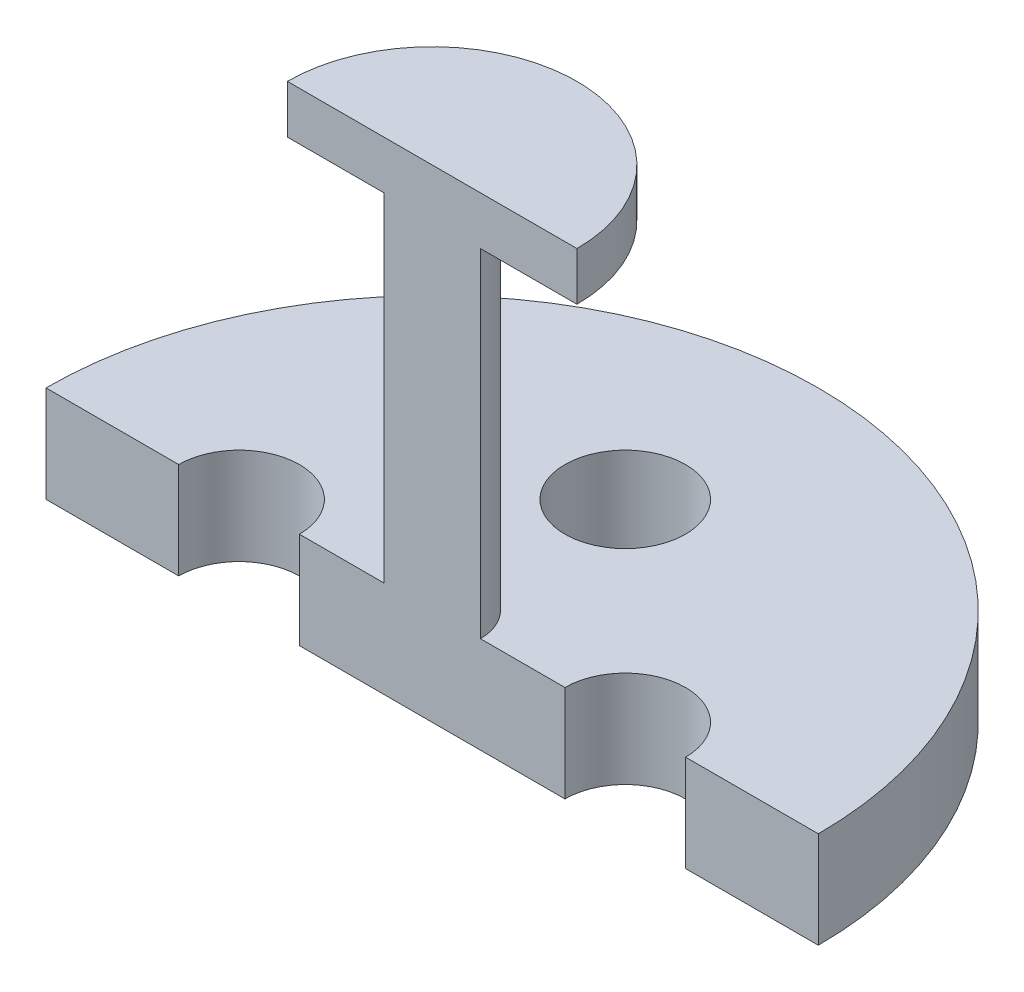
ISO-10303-21;
HEADER;
FILE_DESCRIPTION(('STEP AP214'),'2;1');
FILE_NAME('part.step','',(''),(''),'','','');
FILE_SCHEMA(('AUTOMOTIVE_DESIGN { 1 0 10303 214 1 1 1 1 }'));
ENDSEC;
DATA;
#1=APPLICATION_CONTEXT('core data for automotive mechanical design processes');
#2=APPLICATION_PROTOCOL_DEFINITION('international standard','automotive_design',2000,#1);
#3=PRODUCT_CONTEXT('',#1,'mechanical');
#4=PRODUCT('Part','Part','',(#3));
#5=PRODUCT_RELATED_PRODUCT_CATEGORY('part','',(#4));
#6=PRODUCT_DEFINITION_FORMATION('','',#4);
#7=PRODUCT_DEFINITION_CONTEXT('part definition',#1,'design');
#8=PRODUCT_DEFINITION('design','',#6,#7);
#9=PRODUCT_DEFINITION_SHAPE('','',#8);
#10=(LENGTH_UNIT() NAMED_UNIT(*) SI_UNIT(.MILLI.,.METRE.));
#11=(NAMED_UNIT(*) PLANE_ANGLE_UNIT() SI_UNIT($,.RADIAN.));
#12=(NAMED_UNIT(*) SI_UNIT($,.STERADIAN.) SOLID_ANGLE_UNIT());
#13=UNCERTAINTY_MEASURE_WITH_UNIT(LENGTH_MEASURE(1.E-05),#10,'distance_accuracy_value','');
#14=(GEOMETRIC_REPRESENTATION_CONTEXT(3) GLOBAL_UNCERTAINTY_ASSIGNED_CONTEXT((#13)) GLOBAL_UNIT_ASSIGNED_CONTEXT((#10,
#11,#12)) REPRESENTATION_CONTEXT('',''));
#15=CARTESIAN_POINT('',(0.,0.,0.));
#16=DIRECTION('',(0.,0.,1.));
#17=DIRECTION('',(1.,0.,0.));
#18=AXIS2_PLACEMENT_3D('',#15,#16,#17);
#19=CARTESIAN_POINT('',(0.,71.5910269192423,0.));
#20=DIRECTION('',(0.,1.,0.));
#21=DIRECTION('',(-1.,0.,0.));
#22=AXIS2_PLACEMENT_3D('',#19,#20,#21);
#23=CYLINDRICAL_SURFACE('',#22,8.);
#24=DIRECTION('',(0.,1.,0.));
#25=VECTOR('',#24,1.);
#26=CARTESIAN_POINT('',(-7.99999999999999,0.,0.));
#27=LINE('',#26,#25);
#28=CARTESIAN_POINT('',(-7.99999999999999,0.,0.));
#29=VERTEX_POINT('',#28);
#30=CARTESIAN_POINT('',(-7.99999999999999,2.,0.));
#31=VERTEX_POINT('',#30);
#32=EDGE_CURVE('E124',#29,#31,#27,.T.);
#33=ORIENTED_EDGE('',*,*,#32,.T.);
#34=CARTESIAN_POINT('',(0.,2.,0.));
#35=DIRECTION('',(0.,1.,0.));
#36=DIRECTION('',(-1.,0.,0.));
#37=AXIS2_PLACEMENT_3D('',#34,#35,#36);
#38=CIRCLE('',#37,8.);
#39=CARTESIAN_POINT('',(8.00000000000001,2.,0.));
#40=VERTEX_POINT('',#39);
#41=EDGE_CURVE('E123',#40,#31,#38,.T.);
#42=ORIENTED_EDGE('',*,*,#41,.F.);
#43=DIRECTION('',(0.,1.,0.));
#44=VECTOR('',#43,1.);
#45=CARTESIAN_POINT('',(8.00000000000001,0.,0.));
#46=LINE('',#45,#44);
#47=CARTESIAN_POINT('',(8.00000000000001,0.,0.));
#48=VERTEX_POINT('',#47);
#49=EDGE_CURVE('E109',#48,#40,#46,.T.);
#50=ORIENTED_EDGE('',*,*,#49,.F.);
#51=CARTESIAN_POINT('',(0.,0.,0.));
#52=DIRECTION('',(0.,1.,0.));
#53=DIRECTION('',(-1.,0.,0.));
#54=AXIS2_PLACEMENT_3D('',#51,#52,#53);
#55=CIRCLE('',#54,8.);
#56=EDGE_CURVE('E121',#48,#29,#55,.T.);
#57=ORIENTED_EDGE('',*,*,#56,.T.);
#58=EDGE_LOOP('',(#33,#42,#50,#57));
#59=FACE_BOUND('',#58,.T.);
#60=ADVANCED_FACE('F31',(#59),#23,.T.);
#61=CARTESIAN_POINT('',(0.,10.,0.));
#62=DIRECTION('',(0.,1.,0.));
#63=DIRECTION('',(-1.,0.,0.));
#64=AXIS2_PLACEMENT_3D('',#61,#62,#63);
#65=PLANE('',#64);
#66=DIRECTION('',(-1.,0.,0.));
#67=VECTOR('',#66,1.);
#68=CARTESIAN_POINT('',(-7.99999999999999,10.,0.));
#69=LINE('',#68,#67);
#70=CARTESIAN_POINT('',(3.,10.,0.));
#71=VERTEX_POINT('',#70);
#72=CARTESIAN_POINT('',(-2.99999999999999,10.,0.));
#73=VERTEX_POINT('',#72);
#74=EDGE_CURVE('E199',#71,#73,#69,.T.);
#75=ORIENTED_EDGE('',*,*,#74,.F.);
#76=CARTESIAN_POINT('',(0.,10.,0.));
#77=DIRECTION('',(0.,1.,0.));
#78=DIRECTION('',(-1.,0.,0.));
#79=AXIS2_PLACEMENT_3D('',#76,#77,#78);
#80=CIRCLE('',#79,3.);
#81=EDGE_CURVE('E145',#71,#73,#80,.T.);
#82=ORIENTED_EDGE('',*,*,#81,.T.);
#83=EDGE_LOOP('',(#75,#82));
#84=FACE_BOUND('',#83,.T.);
#85=ADVANCED_FACE('F33',(#84),#65,.T.);
#86=CARTESIAN_POINT('',(0.,71.5910269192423,0.));
#87=DIRECTION('',(0.,1.,0.));
#88=DIRECTION('',(-1.,0.,0.));
#89=AXIS2_PLACEMENT_3D('',#86,#87,#88);
#90=CYLINDRICAL_SURFACE('',#89,3.);
#91=DIRECTION('',(0.,1.,0.));
#92=VECTOR('',#91,1.);
#93=CARTESIAN_POINT('',(-3.,71.5910269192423,0.));
#94=LINE('',#93,#92);
#95=CARTESIAN_POINT('',(-2.99999999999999,9.,0.));
#96=VERTEX_POINT('',#95);
#97=EDGE_CURVE('E193',#73,#96,#94,.F.);
#98=ORIENTED_EDGE('',*,*,#97,.F.);
#99=ORIENTED_EDGE('',*,*,#81,.F.);
#100=DIRECTION('',(0.,1.,0.));
#101=VECTOR('',#100,1.);
#102=CARTESIAN_POINT('',(3.,71.5910269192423,0.));
#103=LINE('',#102,#101);
#104=CARTESIAN_POINT('',(3.,9.,0.));
#105=VERTEX_POINT('',#104);
#106=EDGE_CURVE('E180',#105,#71,#103,.T.);
#107=ORIENTED_EDGE('',*,*,#106,.F.);
#108=CARTESIAN_POINT('',(0.,9.00000000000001,0.));
#109=DIRECTION('',(0.,1.,0.));
#110=DIRECTION('',(-1.,0.,0.));
#111=AXIS2_PLACEMENT_3D('',#108,#109,#110);
#112=CIRCLE('',#111,3.);
#113=EDGE_CURVE('E142',#105,#96,#112,.T.);
#114=ORIENTED_EDGE('',*,*,#113,.T.);
#115=EDGE_LOOP('',(#98,#99,#107,#114));
#116=FACE_BOUND('',#115,.T.);
#117=ADVANCED_FACE('F206',(#116),#90,.T.);
#118=CARTESIAN_POINT('',(-2.99999999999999,9.,0.));
#119=DIRECTION('',(0.,-1.,0.));
#120=DIRECTION('',(1.,0.,0.));
#121=AXIS2_PLACEMENT_3D('',#118,#119,#120);
#122=PLANE('',#121);
#123=DIRECTION('',(1.,0.,0.));
#124=VECTOR('',#123,1.);
#125=CARTESIAN_POINT('',(-2.99999999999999,9.,0.));
#126=LINE('',#125,#124);
#127=CARTESIAN_POINT('',(-0.999999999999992,9.00000000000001,0.));
#128=VERTEX_POINT('',#127);
#129=EDGE_CURVE('E189',#96,#128,#126,.T.);
#130=ORIENTED_EDGE('',*,*,#129,.F.);
#131=ORIENTED_EDGE('',*,*,#113,.F.);
#132=CARTESIAN_POINT('',(1.,9.00000000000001,0.));
#133=VERTEX_POINT('',#132);
#134=EDGE_CURVE('E183',#133,#105,#126,.T.);
#135=ORIENTED_EDGE('',*,*,#134,.F.);
#136=CARTESIAN_POINT('',(0.,9.00000000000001,0.));
#137=DIRECTION('',(0.,1.,0.));
#138=DIRECTION('',(-1.,0.,0.));
#139=AXIS2_PLACEMENT_3D('',#136,#137,#138);
#140=CIRCLE('',#139,0.999999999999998);
#141=EDGE_CURVE('E139',#133,#128,#140,.T.);
#142=ORIENTED_EDGE('',*,*,#141,.T.);
#143=EDGE_LOOP('',(#130,#131,#135,#142));
#144=FACE_BOUND('',#143,.T.);
#145=ADVANCED_FACE('F213',(#144),#122,.T.);
#146=CARTESIAN_POINT('',(0.,71.5910269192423,0.));
#147=DIRECTION('',(0.,1.,0.));
#148=DIRECTION('',(-1.,0.,0.));
#149=AXIS2_PLACEMENT_3D('',#146,#147,#148);
#150=CYLINDRICAL_SURFACE('',#149,0.999999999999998);
#151=DIRECTION('',(0.,1.,0.));
#152=VECTOR('',#151,1.);
#153=CARTESIAN_POINT('',(-0.999999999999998,71.5910269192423,0.));
#154=LINE('',#153,#152);
#155=CARTESIAN_POINT('',(-0.999999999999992,2.,0.));
#156=VERTEX_POINT('',#155);
#157=EDGE_CURVE('E195',#128,#156,#154,.F.);
#158=ORIENTED_EDGE('',*,*,#157,.F.);
#159=ORIENTED_EDGE('',*,*,#141,.F.);
#160=DIRECTION('',(0.,1.,0.));
#161=VECTOR('',#160,1.);
#162=CARTESIAN_POINT('',(0.999999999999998,71.5910269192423,0.));
#163=LINE('',#162,#161);
#164=CARTESIAN_POINT('',(1.,2.,0.));
#165=VERTEX_POINT('',#164);
#166=EDGE_CURVE('E187',#165,#133,#163,.T.);
#167=ORIENTED_EDGE('',*,*,#166,.F.);
#168=CARTESIAN_POINT('',(0.,2.,0.));
#169=DIRECTION('',(0.,1.,0.));
#170=DIRECTION('',(-1.,0.,0.));
#171=AXIS2_PLACEMENT_3D('',#168,#169,#170);
#172=CIRCLE('',#171,0.999999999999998);
#173=EDGE_CURVE('E131',#165,#156,#172,.T.);
#174=ORIENTED_EDGE('',*,*,#173,.T.);
#175=EDGE_LOOP('',(#158,#159,#167,#174));
#176=FACE_BOUND('',#175,.T.);
#177=ADVANCED_FACE('F222',(#176),#150,.T.);
#178=CARTESIAN_POINT('',(-0.999999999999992,2.,0.));
#179=DIRECTION('',(0.,1.,0.));
#180=DIRECTION('',(-1.,0.,0.));
#181=AXIS2_PLACEMENT_3D('',#178,#179,#180);
#182=PLANE('',#181);
#183=DIRECTION('',(-1.,0.,0.));
#184=VECTOR('',#183,1.);
#185=CARTESIAN_POINT('',(-0.999999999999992,2.,0.));
#186=LINE('',#185,#184);
#187=CARTESIAN_POINT('',(5.25,2.,0.));
#188=VERTEX_POINT('',#187);
#189=EDGE_CURVE('E46',#40,#188,#186,.T.);
#190=ORIENTED_EDGE('',*,*,#189,.F.);
#191=ORIENTED_EDGE('',*,*,#41,.T.);
#192=CARTESIAN_POINT('',(-5.25,2.,0.));
#193=VERTEX_POINT('',#192);
#194=EDGE_CURVE('E182',#193,#31,#186,.T.);
#195=ORIENTED_EDGE('',*,*,#194,.F.);
#196=CARTESIAN_POINT('',(-4.,2.,0.));
#197=DIRECTION('',(0.,1.,0.));
#198=DIRECTION('',(-1.,0.,0.));
#199=AXIS2_PLACEMENT_3D('',#196,#197,#198);
#200=CIRCLE('',#199,1.25);
#201=CARTESIAN_POINT('',(-2.75,2.,0.));
#202=VERTEX_POINT('',#201);
#203=EDGE_CURVE('E153',#193,#202,#200,.F.);
#204=ORIENTED_EDGE('',*,*,#203,.T.);
#205=EDGE_CURVE('E196',#156,#202,#186,.T.);
#206=ORIENTED_EDGE('',*,*,#205,.F.);
#207=ORIENTED_EDGE('',*,*,#173,.F.);
#208=CARTESIAN_POINT('',(2.75,2.,0.));
#209=VERTEX_POINT('',#208);
#210=EDGE_CURVE('E175',#209,#165,#186,.T.);
#211=ORIENTED_EDGE('',*,*,#210,.F.);
#212=CARTESIAN_POINT('',(4.,2.,0.));
#213=DIRECTION('',(0.,1.,0.));
#214=DIRECTION('',(-1.,0.,0.));
#215=AXIS2_PLACEMENT_3D('',#212,#213,#214);
#216=CIRCLE('',#215,1.25);
#217=EDGE_CURVE('E133',#209,#188,#216,.F.);
#218=ORIENTED_EDGE('',*,*,#217,.T.);
#219=EDGE_LOOP('',(#190,#191,#195,#204,#206,#207,#211,#218));
#220=FACE_BOUND('',#219,.T.);
#221=CARTESIAN_POINT('',(0.,2.,-4.));
#222=DIRECTION('',(0.,1.,0.));
#223=DIRECTION('',(-1.,0.,0.));
#224=AXIS2_PLACEMENT_3D('',#221,#222,#223);
#225=CIRCLE('',#224,1.25);
#226=CARTESIAN_POINT('',(-1.25000000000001,2.,-4.));
#227=VERTEX_POINT('',#226);
#228=EDGE_CURVE('E156',#227,#227,#225,.F.);
#229=ORIENTED_EDGE('',*,*,#228,.T.);
#230=EDGE_LOOP('',(#229));
#231=FACE_BOUND('',#230,.T.);
#232=ADVANCED_FACE('F172',(#220,#231),#182,.T.);
#233=CARTESIAN_POINT('',(-7.99999999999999,0.,0.));
#234=DIRECTION('',(0.,-1.,0.));
#235=DIRECTION('',(1.,0.,0.));
#236=AXIS2_PLACEMENT_3D('',#233,#234,#235);
#237=PLANE('',#236);
#238=DIRECTION('',(-1.,0.,0.));
#239=VECTOR('',#238,1.);
#240=CARTESIAN_POINT('',(-7.99999999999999,0.,0.));
#241=LINE('',#240,#239);
#242=CARTESIAN_POINT('',(-5.25,0.,0.));
#243=VERTEX_POINT('',#242);
#244=EDGE_CURVE('E54',#243,#29,#241,.T.);
#245=ORIENTED_EDGE('',*,*,#244,.T.);
#246=ORIENTED_EDGE('',*,*,#56,.F.);
#247=CARTESIAN_POINT('',(5.25,0.,0.));
#248=VERTEX_POINT('',#247);
#249=EDGE_CURVE('E106',#48,#248,#241,.T.);
#250=ORIENTED_EDGE('',*,*,#249,.T.);
#251=CARTESIAN_POINT('',(4.,0.,0.));
#252=DIRECTION('',(0.,-1.,0.));
#253=DIRECTION('',(1.,0.,0.));
#254=AXIS2_PLACEMENT_3D('',#251,#252,#253);
#255=CIRCLE('',#254,1.25);
#256=CARTESIAN_POINT('',(2.75,0.,0.));
#257=VERTEX_POINT('',#256);
#258=EDGE_CURVE('E129',#257,#248,#255,.T.);
#259=ORIENTED_EDGE('',*,*,#258,.F.);
#260=CARTESIAN_POINT('',(-2.75,0.,0.));
#261=VERTEX_POINT('',#260);
#262=EDGE_CURVE('E115',#257,#261,#241,.T.);
#263=ORIENTED_EDGE('',*,*,#262,.T.);
#264=CARTESIAN_POINT('',(-4.,0.,0.));
#265=DIRECTION('',(0.,-1.,0.));
#266=DIRECTION('',(-1.,0.,0.));
#267=AXIS2_PLACEMENT_3D('',#264,#265,#266);
#268=CIRCLE('',#267,1.25);
#269=EDGE_CURVE('E151',#243,#261,#268,.T.);
#270=ORIENTED_EDGE('',*,*,#269,.F.);
#271=EDGE_LOOP('',(#245,#246,#250,#259,#263,#270));
#272=FACE_BOUND('',#271,.T.);
#273=CARTESIAN_POINT('',(0.,0.,-4.));
#274=DIRECTION('',(0.,-1.,0.));
#275=DIRECTION('',(0.,0.,-1.));
#276=AXIS2_PLACEMENT_3D('',#273,#274,#275);
#277=CIRCLE('',#276,1.25);
#278=CARTESIAN_POINT('',(0.,0.,-5.25));
#279=VERTEX_POINT('',#278);
#280=EDGE_CURVE('E159',#279,#279,#277,.T.);
#281=ORIENTED_EDGE('',*,*,#280,.F.);
#282=EDGE_LOOP('',(#281));
#283=FACE_BOUND('',#282,.T.);
#284=ADVANCED_FACE('F126',(#272,#283),#237,.T.);
#285=CARTESIAN_POINT('',(4.,10.001,0.));
#286=DIRECTION('',(0.,-1.,0.));
#287=DIRECTION('',(1.,0.,0.));
#288=AXIS2_PLACEMENT_3D('',#285,#286,#287);
#289=CYLINDRICAL_SURFACE('',#288,1.25);
#290=ORIENTED_EDGE('',*,*,#258,.T.);
#291=DIRECTION('',(0.,-1.,0.));
#292=VECTOR('',#291,1.);
#293=CARTESIAN_POINT('',(5.25,10.001,0.));
#294=LINE('',#293,#292);
#295=EDGE_CURVE('E110',#248,#188,#294,.F.);
#296=ORIENTED_EDGE('',*,*,#295,.T.);
#297=ORIENTED_EDGE('',*,*,#217,.F.);
#298=DIRECTION('',(0.,-1.,0.));
#299=VECTOR('',#298,1.);
#300=CARTESIAN_POINT('',(2.75,10.001,0.));
#301=LINE('',#300,#299);
#302=EDGE_CURVE('E179',#209,#257,#301,.T.);
#303=ORIENTED_EDGE('',*,*,#302,.T.);
#304=EDGE_LOOP('',(#290,#296,#297,#303));
#305=FACE_BOUND('',#304,.T.);
#306=ADVANCED_FACE('F178',(#305),#289,.F.);
#307=CARTESIAN_POINT('',(0.,10.001,-4.));
#308=DIRECTION('',(0.,-1.,0.));
#309=DIRECTION('',(1.,0.,0.));
#310=AXIS2_PLACEMENT_3D('',#307,#308,#309);
#311=CYLINDRICAL_SURFACE('',#310,1.25);
#312=ORIENTED_EDGE('',*,*,#228,.F.);
#313=EDGE_LOOP('',(#312));
#314=FACE_BOUND('',#313,.T.);
#315=ORIENTED_EDGE('',*,*,#280,.T.);
#316=EDGE_LOOP('',(#315));
#317=FACE_BOUND('',#316,.T.);
#318=ADVANCED_FACE('F242',(#314,#317),#311,.F.);
#319=CARTESIAN_POINT('',(-4.,10.001,0.));
#320=DIRECTION('',(0.,-1.,0.));
#321=DIRECTION('',(1.,0.,0.));
#322=AXIS2_PLACEMENT_3D('',#319,#320,#321);
#323=CYLINDRICAL_SURFACE('',#322,1.25);
#324=ORIENTED_EDGE('',*,*,#269,.T.);
#325=DIRECTION('',(0.,-1.,0.));
#326=VECTOR('',#325,1.);
#327=CARTESIAN_POINT('',(-2.75,10.001,0.));
#328=LINE('',#327,#326);
#329=EDGE_CURVE('E11',#261,#202,#328,.F.);
#330=ORIENTED_EDGE('',*,*,#329,.T.);
#331=ORIENTED_EDGE('',*,*,#203,.F.);
#332=DIRECTION('',(0.,-1.,0.));
#333=VECTOR('',#332,1.);
#334=CARTESIAN_POINT('',(-5.25,10.001,0.));
#335=LINE('',#334,#333);
#336=EDGE_CURVE('E39',#193,#243,#335,.T.);
#337=ORIENTED_EDGE('',*,*,#336,.T.);
#338=EDGE_LOOP('',(#324,#330,#331,#337));
#339=FACE_BOUND('',#338,.T.);
#340=ADVANCED_FACE('F150',(#339),#323,.F.);
#341=CARTESIAN_POINT('',(-7.99999999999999,0.,0.));
#342=DIRECTION('',(0.,0.,-1.));
#343=DIRECTION('',(-1.,0.,0.));
#344=AXIS2_PLACEMENT_3D('',#341,#342,#343);
#345=PLANE('',#344);
#346=ORIENTED_EDGE('',*,*,#194,.T.);
#347=ORIENTED_EDGE('',*,*,#32,.F.);
#348=ORIENTED_EDGE('',*,*,#244,.F.);
#349=ORIENTED_EDGE('',*,*,#336,.F.);
#350=EDGE_LOOP('',(#346,#347,#348,#349));
#351=FACE_BOUND('',#350,.T.);
#352=ADVANCED_FACE('F235',(#351),#345,.F.);
#353=ORIENTED_EDGE('',*,*,#106,.T.);
#354=ORIENTED_EDGE('',*,*,#74,.T.);
#355=ORIENTED_EDGE('',*,*,#97,.T.);
#356=ORIENTED_EDGE('',*,*,#129,.T.);
#357=ORIENTED_EDGE('',*,*,#157,.T.);
#358=ORIENTED_EDGE('',*,*,#205,.T.);
#359=ORIENTED_EDGE('',*,*,#329,.F.);
#360=ORIENTED_EDGE('',*,*,#262,.F.);
#361=ORIENTED_EDGE('',*,*,#302,.F.);
#362=ORIENTED_EDGE('',*,*,#210,.T.);
#363=ORIENTED_EDGE('',*,*,#166,.T.);
#364=ORIENTED_EDGE('',*,*,#134,.T.);
#365=EDGE_LOOP('',(#353,#354,#355,#356,#357,#358,#359,#360,#361,#362,#363,#364));
#366=FACE_BOUND('',#365,.T.);
#367=ADVANCED_FACE('F201',(#366),#345,.F.);
#368=ORIENTED_EDGE('',*,*,#189,.T.);
#369=ORIENTED_EDGE('',*,*,#295,.F.);
#370=ORIENTED_EDGE('',*,*,#249,.F.);
#371=ORIENTED_EDGE('',*,*,#49,.T.);
#372=EDGE_LOOP('',(#368,#369,#370,#371));
#373=FACE_BOUND('',#372,.T.);
#374=ADVANCED_FACE('F108',(#373),#345,.F.);
#375=CLOSED_SHELL('',(#60,#85,#117,#145,#177,#232,#284,#306,#318,#340,#352,#367,#374));
#376=MANIFOLD_SOLID_BREP('B2',#375);
#377=ADVANCED_BREP_SHAPE_REPRESENTATION('',(#18,#376),#14);
#378=SHAPE_DEFINITION_REPRESENTATION(#9,#377);
ENDSEC;
END-ISO-10303-21;
